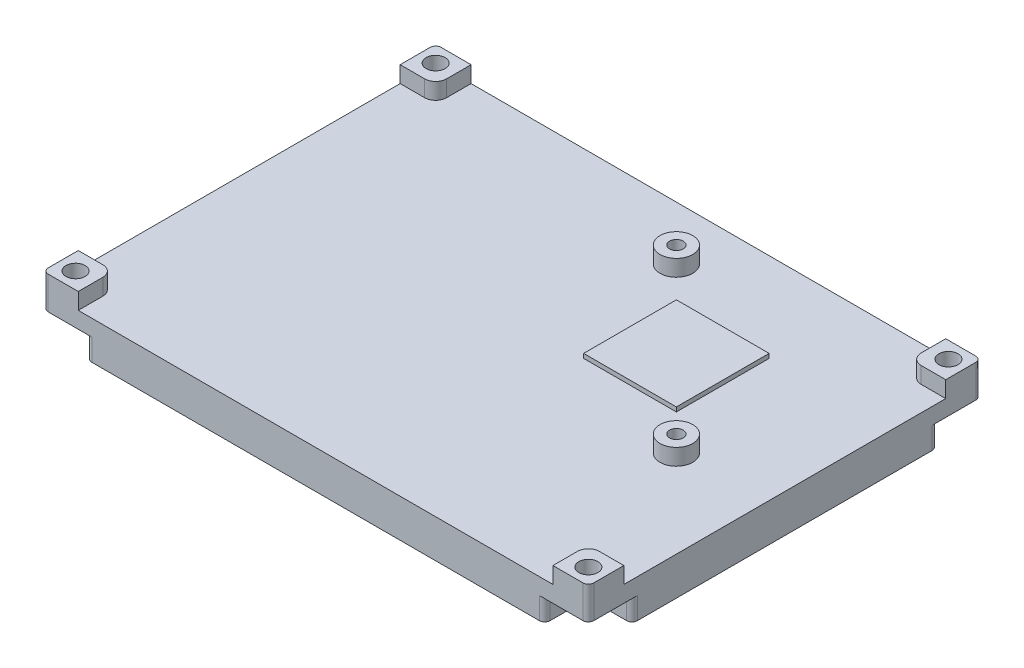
from build123d import *

# Parameters (mm, degrees)
SKETCH1_W           = 100
SKETCH1_H           = 72
SKETCH1_R           = 1.75
BOSS_EXTRUDE1_DEPTH = 10
SKETCH2_R           = 3
SKETCH2_W           = 17
SKETCH2_H           = 17
CUT_EXTRUDE1_DEPTH  = 3
SKETCH3_R           = 1.25
CUT_EXTRUDE2_DEPTH  = 6
SKETCH4_R           = 1.25
CUT_EXTRUDE3_DEPTH  = 6
SKETCH6_W           = 17
SKETCH6_H           = 17
CUT_EXTRUDE4_DEPTH  = 2.2
SKETCH7_W           = 8
SKETCH7_H           = 8
CUT_EXTRUDE5_DEPTH  = 4
FILLET2_R           = 2
FILLET3_R           = 1


with BuildPart() as part:
    # Sketch1 → Boss-Extrude1 (new body)
    with BuildSketch(Plane(origin=(0, 0, 0), x_dir=(1, 0, 0), z_dir=(0, 1, 0))):
        with Locations((50, 36)):
            Rectangle(SKETCH1_W, SKETCH1_H)
        with Locations(Location((3, 69, 0), (0, 0, 270))):
            Circle(SKETCH1_R, mode=Mode.SUBTRACT)
        with Locations(Location((97, 69, 0), (0, 0, 270))):
            Circle(SKETCH1_R, mode=Mode.SUBTRACT)
        with Locations(Location((97, 3, 0), (0, 0, 270))):
            Circle(SKETCH1_R, mode=Mode.SUBTRACT)
        with Locations(Location((3, 3, 0), (0, 0, 270))):
            Circle(SKETCH1_R, mode=Mode.SUBTRACT)
    extrude(amount=BOSS_EXTRUDE1_DEPTH)

    # Sketch2 → Cut-Extrude1 (cut)
    with BuildSketch(Plane(origin=(0, 10, 0), x_dir=(1, 0, 0), z_dir=(0, 1, 0))):
        Polygon((6.5, 72), (93.5, 72), (93.5, 65.5), (100, 65.5), (100, 6.5), (93.5, 6.5), (93.5, 0), (6.5, 0), (6.5, 6.5), (0, 6.5), (0, 65.5), (6.5, 65.5), align=None)
        with Locations(Location((53.94, 62.19, 0), (0, 0, 270))):
            Circle(SKETCH2_R, mode=Mode.SUBTRACT)
        with Locations(Location((83.94, 32.19, 0), (0, 0, 270))):
            Circle(SKETCH2_R, mode=Mode.SUBTRACT)
        with Locations((68.94, 47.19)):
            Rectangle(SKETCH2_W, SKETCH2_H, mode=Mode.SUBTRACT)
    extrude(amount=-CUT_EXTRUDE1_DEPTH, mode=Mode.SUBTRACT)

    # Sketch3 → Cut-Extrude2 (cut)
    with BuildSketch(Plane(origin=(0, 10, 0), x_dir=(1, 0, 0), z_dir=(0, 1, 0))):
        with Locations(Location((53.94, 62.19, 0), (0, 0, 270))):
            Circle(SKETCH3_R)
        with Locations(Location((83.94, 32.19, 0), (0, 0, 270))):
            Circle(SKETCH3_R)
    extrude(amount=-CUT_EXTRUDE2_DEPTH, mode=Mode.SUBTRACT)

    # Sketch4 → Cut-Extrude3 (cut)
    with BuildSketch(Plane.XZ):
        with Locations(Location((25, -11, 0), (0, 0, 270))):
            Circle(SKETCH4_R)
        with Locations(Location((75, -11, 0), (0, 0, 270))):
            Circle(SKETCH4_R)
        with Locations(Location((75, -61, 0), (0, 0, 270))):
            Circle(SKETCH4_R)
        with Locations(Location((25, -61, 0), (0, 0, 270))):
            Circle(SKETCH4_R)
    extrude(amount=-CUT_EXTRUDE3_DEPTH, mode=Mode.SUBTRACT)

    # Sketch6 → Cut-Extrude4 (cut)
    with BuildSketch(Plane(origin=(0, 10, 0), x_dir=(1, 0, 0), z_dir=(0, 1, 0))):
        with Locations((68.94, 47.19)):
            Rectangle(SKETCH6_W, SKETCH6_H)
    extrude(amount=-CUT_EXTRUDE4_DEPTH, mode=Mode.SUBTRACT)

    # Sketch7 → Cut-Extrude5 (cut)
    with BuildSketch(Plane.XZ):
        with Locations((4, -4)):
            Rectangle(SKETCH7_W, SKETCH7_H)
        with Locations((96, -4)):
            Rectangle(SKETCH7_W, SKETCH7_H)
        with Locations((4, -68)):
            Rectangle(SKETCH7_W, SKETCH7_H)
        with Locations((96, -68)):
            Rectangle(SKETCH7_W, SKETCH7_H)
    extrude(amount=-CUT_EXTRUDE5_DEPTH, mode=Mode.SUBTRACT)

    # Fillet2
    fillet2_edges = [part.edges().sort_by_distance(p)[0] for p in [
        (92, 2, -8),
        (8, 2, -64),
        (92, 2, -64),
        (8, 2, -8),
        (6.5, 8.5, -65.5),
        (93.5, 8.5, -65.5),
        (93.5, 8.5, -6.5),
        (6.5, 8.5, -6.5),
    ]]
    fillet(fillet2_edges, radius=FILLET2_R)

    # Fillet3
    fillet3_edges = [part.edges().sort_by_distance(p)[0] for p in [
        (100, 2, -8),
        (92, 2, 0),
        (0, 2, -64),
        (8, 2, -72),
        (100, 2, -64),
        (92, 2, -72),
        (0, 2, -8),
        (8, 2, 0),
        (0, 7, -72),
        (100, 7, -72),
        (100, 7, 0),
        (0, 7, 0),
    ]]
    fillet(fillet3_edges, radius=FILLET3_R)


solid = part.part
